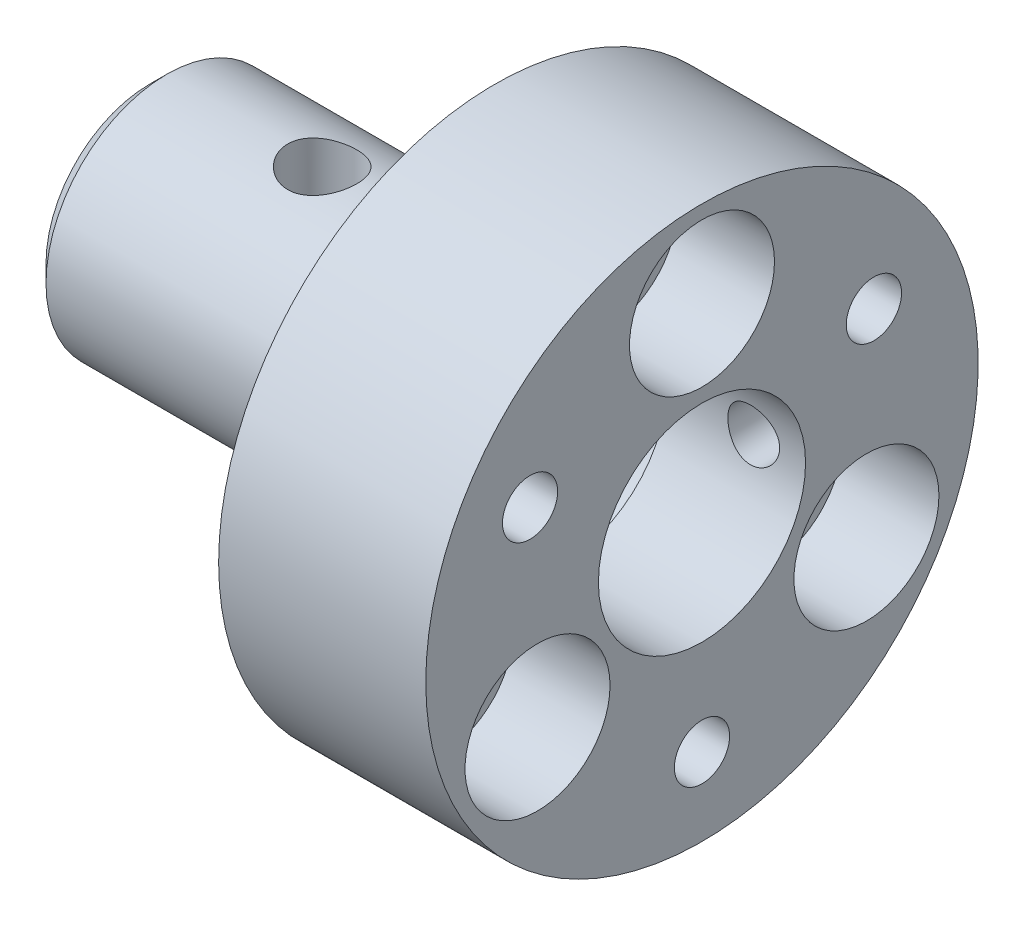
from build123d import *

# Parameters (mm, degrees)
STIRNSENKUNG_F_R_M2_ZYLINDERSCHRAUBE_MIT_D           = 2.2
STIRNSENKUNG_F_R_M2_ZYLINDERSCHRAUBE_MIT_CBORE_D     = 4.2
STIRNSENKUNG_F_R_M2_ZYLINDERSCHRAUBE_MIT_CBORE_DEPTH = 2.8
M2_GEWINDEBOHRUNG1_D                                 = 1.6
KREISMUSTER1_COUNT                                   = 3
SKIZZE7_R                                            = 0.75
LINEAR_AUSTRAGEN2_DEPTH                              = 69.554676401
SKIZZE8_R                                            = 1
SCHNITT_LINEAR_AUSTRAGEN1_DEPTH                      = 4
SKIZZE9_OUTSIDE_W                                    = 23.542
SKIZZE9_OUTSIDE_H                                    = 23.542
SKIZZE9_OUTSIDE_R                                    = 3.75
LINEAR_AUSTRAGEN3_DEPTH                              = 2.9


with BuildPart() as part:
    # Skizze1 → Rotation1 (revolve)
    with BuildSketch(Plane.XY, mode=Mode.PRIVATE) as rotation1_sk:
        Polygon((53.614670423, 1.7), (53.614670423, 2.2), (51.614670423, 2.2), (51.614670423, 3), (52.114670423, 3.5), (58.714670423, 3.5), (58.714670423, 3.9), (61.614670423, 3.9), (61.614670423, 8), (67.614670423, 8), (67.614670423, 3), (63.614670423, 3), (63.614670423, 3.25), (62.614670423, 3.25), (62.614670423, 2), (60.614670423, 2), (60.614670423, 1.7), align=None)
    revolve(rotation1_sk.sketch.rotate(Axis((0, 0, 0), (1, 0, 0)), 90), axis=Axis((0, 0, 0), (1, 0, 0)))

    # Stirnsenkung f_r M2 Zylinderschraube mit (through all)
    with Locations(Plane(origin=(67.614670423, 3.349277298, 3.846388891), x_dir=(0, 0, -1), z_dir=(1, 0, 0))):
        with Locations((3.846388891, 2.150722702)):
            stirnsenkung_f_r_m2_zylinderschraube_mit = CounterBoreHole(STIRNSENKUNG_F_R_M2_ZYLINDERSCHRAUBE_MIT_D / 2, STIRNSENKUNG_F_R_M2_ZYLINDERSCHRAUBE_MIT_CBORE_D / 2, STIRNSENKUNG_F_R_M2_ZYLINDERSCHRAUBE_MIT_CBORE_DEPTH)

    # M2 Gewindebohrung1 (through all)
    with Locations(Plane(origin=(67.614670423, 9.333311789, 3.277894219), x_dir=(0, 0, -1), z_dir=(1, 0, 0))):
        with Locations((3.277894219, -15.083311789)):
            m2_gewindebohrung1 = Hole(M2_GEWINDEBOHRUNG1_D / 2)

    # Kreismuster1: Stirnsenkung f_r M2 Zylinderschraube mit, M2 Gewindebohrung1 ×3 about axis
    kreismuster1_axis = Axis((0, 0, 0), (1, 0, 0))
    add([stirnsenkung_f_r_m2_zylinderschraube_mit.rotate(kreismuster1_axis, i * 360 / KREISMUSTER1_COUNT) for i in range(1, KREISMUSTER1_COUNT)], mode=Mode.SUBTRACT)
    add([m2_gewindebohrung1.rotate(kreismuster1_axis, i * 360 / KREISMUSTER1_COUNT) for i in range(1, KREISMUSTER1_COUNT)], mode=Mode.SUBTRACT)

    # Skizze7 → Linear austragen2 (cut, through all)
    with BuildSketch(Plane.XY):
        with Locations((66.114670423, 0)):
            Circle(SKIZZE7_R)
    extrude(amount=-LINEAR_AUSTRAGEN2_DEPTH, mode=Mode.SUBTRACT)

    # Skizze8 → Schnitt-Linear austragen1 (cut, symmetric)
    with BuildSketch(Plane(origin=(0, 0, 0), x_dir=(1, 0, 0), z_dir=(0, 1, 0))):
        with Locations(Location((56.614670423, 0, 0), (0, 0, 270))):
            Circle(SKIZZE8_R)
    extrude(amount=SCHNITT_LINEAR_AUSTRAGEN1_DEPTH, both=True, mode=Mode.SUBTRACT)

    # Skizze9 outside → Linear austragen3 (cut)
    with BuildSketch(Plane.ZY.offset(-58.714670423)):
        Rectangle(SKIZZE9_OUTSIDE_W, SKIZZE9_OUTSIDE_H)
        Circle(SKIZZE9_OUTSIDE_R, mode=Mode.SUBTRACT)
    extrude(amount=-LINEAR_AUSTRAGEN3_DEPTH, mode=Mode.SUBTRACT)


solid = part.part
